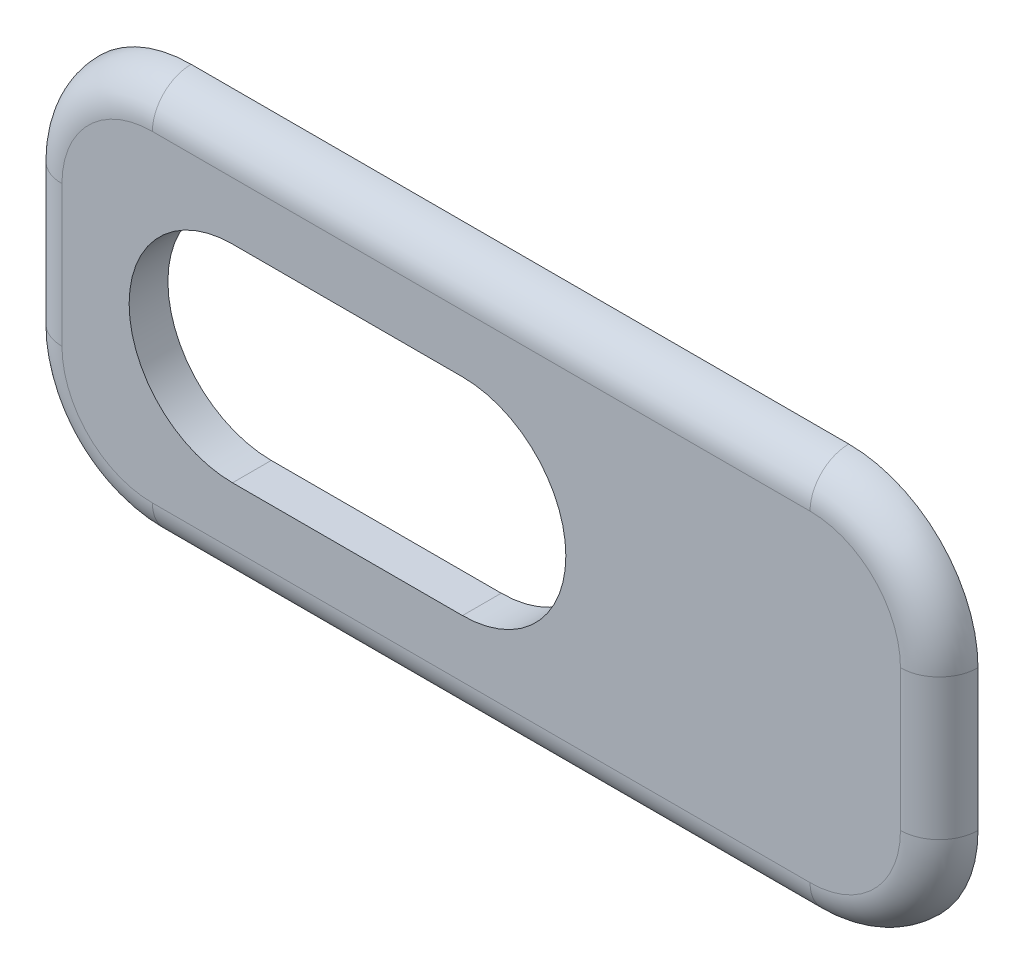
ISO-10303-21;
HEADER;
FILE_DESCRIPTION(('STEP AP214'),'2;1');
FILE_NAME('part.step','',(''),(''),'','','');
FILE_SCHEMA(('AUTOMOTIVE_DESIGN { 1 0 10303 214 1 1 1 1 }'));
ENDSEC;
DATA;
#1=APPLICATION_CONTEXT('core data for automotive mechanical design processes');
#2=APPLICATION_PROTOCOL_DEFINITION('international standard','automotive_design',2000,#1);
#3=PRODUCT_CONTEXT('',#1,'mechanical');
#4=PRODUCT('Part','Part','',(#3));
#5=PRODUCT_RELATED_PRODUCT_CATEGORY('part','',(#4));
#6=PRODUCT_DEFINITION_FORMATION('','',#4);
#7=PRODUCT_DEFINITION_CONTEXT('part definition',#1,'design');
#8=PRODUCT_DEFINITION('design','',#6,#7);
#9=PRODUCT_DEFINITION_SHAPE('','',#8);
#10=(LENGTH_UNIT() NAMED_UNIT(*) SI_UNIT(.MILLI.,.METRE.));
#11=(NAMED_UNIT(*) PLANE_ANGLE_UNIT() SI_UNIT($,.RADIAN.));
#12=(NAMED_UNIT(*) SI_UNIT($,.STERADIAN.) SOLID_ANGLE_UNIT());
#13=UNCERTAINTY_MEASURE_WITH_UNIT(LENGTH_MEASURE(1.E-05),#10,'distance_accuracy_value','');
#14=(GEOMETRIC_REPRESENTATION_CONTEXT(3) GLOBAL_UNCERTAINTY_ASSIGNED_CONTEXT((#13)) GLOBAL_UNIT_ASSIGNED_CONTEXT((#10,
#11,#12)) REPRESENTATION_CONTEXT('',''));
#15=CARTESIAN_POINT('',(0.,0.,0.));
#16=DIRECTION('',(0.,0.,1.));
#17=DIRECTION('',(1.,0.,0.));
#18=AXIS2_PLACEMENT_3D('',#15,#16,#17);
#19=CARTESIAN_POINT('',(-25.45,-5.45,1.5));
#20=DIRECTION('',(0.,0.,1.));
#21=DIRECTION('',(1.,0.,0.));
#22=AXIS2_PLACEMENT_3D('',#19,#20,#21);
#23=PLANE('',#22);
#24=CARTESIAN_POINT('',(-19.25,0.,1.5));
#25=DIRECTION('',(0.,0.,1.));
#26=DIRECTION('',(1.,0.,0.));
#27=AXIS2_PLACEMENT_3D('',#24,#25,#26);
#28=CIRCLE('',#27,8.);
#29=CARTESIAN_POINT('',(-19.25,8.,1.5));
#30=VERTEX_POINT('',#29);
#31=CARTESIAN_POINT('',(-19.25,-8.,1.5));
#32=VERTEX_POINT('',#31);
#33=EDGE_CURVE('E50',#30,#32,#28,.T.);
#34=ORIENTED_EDGE('',*,*,#33,.F.);
#35=DIRECTION('',(-1.,0.,0.));
#36=VECTOR('',#35,1.);
#37=CARTESIAN_POINT('',(-19.25,8.,1.5));
#38=LINE('',#37,#36);
#39=CARTESIAN_POINT('',(-1.45000000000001,8.,1.5));
#40=VERTEX_POINT('',#39);
#41=EDGE_CURVE('E142',#40,#30,#38,.T.);
#42=ORIENTED_EDGE('',*,*,#41,.F.);
#43=CARTESIAN_POINT('',(-1.45000000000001,0.,1.5));
#44=DIRECTION('',(0.,0.,1.));
#45=DIRECTION('',(1.,0.,0.));
#46=AXIS2_PLACEMENT_3D('',#43,#44,#45);
#47=CIRCLE('',#46,8.);
#48=CARTESIAN_POINT('',(-1.45000000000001,-8.,1.5));
#49=VERTEX_POINT('',#48);
#50=EDGE_CURVE('E145',#49,#40,#47,.T.);
#51=ORIENTED_EDGE('',*,*,#50,.F.);
#52=DIRECTION('',(1.,0.,0.));
#53=VECTOR('',#52,1.);
#54=CARTESIAN_POINT('',(-19.25,-8.,1.5));
#55=LINE('',#54,#53);
#56=EDGE_CURVE('E151',#32,#49,#55,.T.);
#57=ORIENTED_EDGE('',*,*,#56,.F.);
#58=EDGE_LOOP('',(#34,#42,#51,#57));
#59=FACE_BOUND('',#58,.T.);
#60=DIRECTION('',(0.,1.,0.));
#61=VECTOR('',#60,1.);
#62=CARTESIAN_POINT('',(32.45,5.44999999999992,1.5));
#63=LINE('',#62,#61);
#64=CARTESIAN_POINT('',(32.45,-5.44999999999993,1.5));
#65=VERTEX_POINT('',#64);
#66=CARTESIAN_POINT('',(32.45,5.44999999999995,1.5));
#67=VERTEX_POINT('',#66);
#68=EDGE_CURVE('E42',#65,#67,#63,.T.);
#69=ORIENTED_EDGE('',*,*,#68,.T.);
#70=CARTESIAN_POINT('',(25.45,5.44999999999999,1.5));
#71=DIRECTION('',(0.,0.,1.));
#72=DIRECTION('',(1.,0.,0.));
#73=AXIS2_PLACEMENT_3D('',#70,#71,#72);
#74=CIRCLE('',#73,7.);
#75=CARTESIAN_POINT('',(25.45,12.45,1.5));
#76=VERTEX_POINT('',#75);
#77=EDGE_CURVE('E11',#67,#76,#74,.T.);
#78=ORIENTED_EDGE('',*,*,#77,.T.);
#79=DIRECTION('',(-1.,0.,0.));
#80=VECTOR('',#79,1.);
#81=CARTESIAN_POINT('',(-25.4499999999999,12.45,1.5));
#82=LINE('',#81,#80);
#83=CARTESIAN_POINT('',(-25.45,12.45,1.5));
#84=VERTEX_POINT('',#83);
#85=EDGE_CURVE('E185',#76,#84,#82,.T.);
#86=ORIENTED_EDGE('',*,*,#85,.T.);
#87=CARTESIAN_POINT('',(-25.45,5.45,1.5));
#88=DIRECTION('',(0.,0.,1.));
#89=DIRECTION('',(1.,0.,0.));
#90=AXIS2_PLACEMENT_3D('',#87,#88,#89);
#91=CIRCLE('',#90,7.);
#92=CARTESIAN_POINT('',(-32.45,5.44999999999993,1.5));
#93=VERTEX_POINT('',#92);
#94=EDGE_CURVE('E187',#84,#93,#91,.T.);
#95=ORIENTED_EDGE('',*,*,#94,.T.);
#96=DIRECTION('',(0.,-1.,0.));
#97=VECTOR('',#96,1.);
#98=CARTESIAN_POINT('',(-32.45,-5.44999999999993,1.5));
#99=LINE('',#98,#97);
#100=CARTESIAN_POINT('',(-32.45,-5.44999999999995,1.5));
#101=VERTEX_POINT('',#100);
#102=EDGE_CURVE('E189',#93,#101,#99,.T.);
#103=ORIENTED_EDGE('',*,*,#102,.T.);
#104=CARTESIAN_POINT('',(-25.45,-5.45,1.5));
#105=DIRECTION('',(0.,0.,1.));
#106=DIRECTION('',(1.,0.,0.));
#107=AXIS2_PLACEMENT_3D('',#104,#105,#106);
#108=CIRCLE('',#107,7.);
#109=CARTESIAN_POINT('',(-25.4499999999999,-12.45,1.5));
#110=VERTEX_POINT('',#109);
#111=EDGE_CURVE('E191',#101,#110,#108,.T.);
#112=ORIENTED_EDGE('',*,*,#111,.T.);
#113=DIRECTION('',(1.,0.,0.));
#114=VECTOR('',#113,1.);
#115=CARTESIAN_POINT('',(25.4499999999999,-12.45,1.5));
#116=LINE('',#115,#114);
#117=CARTESIAN_POINT('',(25.45,-12.45,1.5));
#118=VERTEX_POINT('',#117);
#119=EDGE_CURVE('E193',#110,#118,#116,.T.);
#120=ORIENTED_EDGE('',*,*,#119,.T.);
#121=CARTESIAN_POINT('',(25.45,-5.45,1.5));
#122=DIRECTION('',(0.,0.,1.));
#123=DIRECTION('',(1.,0.,0.));
#124=AXIS2_PLACEMENT_3D('',#121,#122,#123);
#125=CIRCLE('',#124,7.);
#126=EDGE_CURVE('E195',#118,#65,#125,.T.);
#127=ORIENTED_EDGE('',*,*,#126,.T.);
#128=EDGE_LOOP('',(#69,#78,#86,#95,#103,#112,#120,#127));
#129=FACE_BOUND('',#128,.T.);
#130=ADVANCED_FACE('F33',(#59,#129),#23,.T.);
#131=CARTESIAN_POINT('',(-25.45,-5.45,-1.5));
#132=DIRECTION('',(0.,0.,1.));
#133=DIRECTION('',(1.,0.,0.));
#134=AXIS2_PLACEMENT_3D('',#131,#132,#133);
#135=PLANE('',#134);
#136=DIRECTION('',(-1.,0.,0.));
#137=VECTOR('',#136,1.);
#138=CARTESIAN_POINT('',(-19.25,8.,-1.5));
#139=LINE('',#138,#137);
#140=CARTESIAN_POINT('',(-1.45000000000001,8.,-1.5));
#141=VERTEX_POINT('',#140);
#142=CARTESIAN_POINT('',(-19.25,8.,-1.5));
#143=VERTEX_POINT('',#142);
#144=EDGE_CURVE('E132',#141,#143,#139,.T.);
#145=ORIENTED_EDGE('',*,*,#144,.T.);
#146=CARTESIAN_POINT('',(-19.25,0.,-1.5));
#147=DIRECTION('',(0.,0.,1.));
#148=DIRECTION('',(1.,0.,0.));
#149=AXIS2_PLACEMENT_3D('',#146,#147,#148);
#150=CIRCLE('',#149,8.);
#151=CARTESIAN_POINT('',(-19.25,-8.,-1.5));
#152=VERTEX_POINT('',#151);
#153=EDGE_CURVE('E126',#143,#152,#150,.T.);
#154=ORIENTED_EDGE('',*,*,#153,.T.);
#155=DIRECTION('',(1.,0.,0.));
#156=VECTOR('',#155,1.);
#157=CARTESIAN_POINT('',(-19.25,-8.,-1.5));
#158=LINE('',#157,#156);
#159=CARTESIAN_POINT('',(-1.45000000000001,-8.,-1.5));
#160=VERTEX_POINT('',#159);
#161=EDGE_CURVE('E135',#152,#160,#158,.T.);
#162=ORIENTED_EDGE('',*,*,#161,.T.);
#163=CARTESIAN_POINT('',(-1.45000000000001,0.,-1.5));
#164=DIRECTION('',(0.,0.,1.));
#165=DIRECTION('',(1.,0.,0.));
#166=AXIS2_PLACEMENT_3D('',#163,#164,#165);
#167=CIRCLE('',#166,8.);
#168=EDGE_CURVE('E58',#160,#141,#167,.T.);
#169=ORIENTED_EDGE('',*,*,#168,.T.);
#170=EDGE_LOOP('',(#145,#154,#162,#169));
#171=FACE_BOUND('',#170,.T.);
#172=CARTESIAN_POINT('',(-25.45,-5.45,-1.5));
#173=DIRECTION('',(0.,0.,1.));
#174=DIRECTION('',(1.,0.,0.));
#175=AXIS2_PLACEMENT_3D('',#172,#173,#174);
#176=CIRCLE('',#175,10.);
#177=CARTESIAN_POINT('',(-35.45,-5.44999999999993,-1.5));
#178=VERTEX_POINT('',#177);
#179=CARTESIAN_POINT('',(-25.4499999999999,-15.45,-1.5));
#180=VERTEX_POINT('',#179);
#181=EDGE_CURVE('E161',#178,#180,#176,.T.);
#182=ORIENTED_EDGE('',*,*,#181,.F.);
#183=DIRECTION('',(0.,-1.,0.));
#184=VECTOR('',#183,1.);
#185=CARTESIAN_POINT('',(-35.45,5.44999999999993,-1.5));
#186=LINE('',#185,#184);
#187=CARTESIAN_POINT('',(-35.45,5.44999999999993,-1.5));
#188=VERTEX_POINT('',#187);
#189=EDGE_CURVE('E182',#188,#178,#186,.T.);
#190=ORIENTED_EDGE('',*,*,#189,.F.);
#191=CARTESIAN_POINT('',(-25.45,5.45,-1.5));
#192=DIRECTION('',(0.,0.,1.));
#193=DIRECTION('',(1.,0.,0.));
#194=AXIS2_PLACEMENT_3D('',#191,#192,#193);
#195=CIRCLE('',#194,10.);
#196=CARTESIAN_POINT('',(-25.4499999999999,15.45,-1.5));
#197=VERTEX_POINT('',#196);
#198=EDGE_CURVE('E179',#197,#188,#195,.T.);
#199=ORIENTED_EDGE('',*,*,#198,.F.);
#200=DIRECTION('',(-1.,0.,0.));
#201=VECTOR('',#200,1.);
#202=CARTESIAN_POINT('',(-25.4499999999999,15.45,-1.5));
#203=LINE('',#202,#201);
#204=CARTESIAN_POINT('',(25.4499999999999,15.45,-1.5));
#205=VERTEX_POINT('',#204);
#206=EDGE_CURVE('E176',#205,#197,#203,.T.);
#207=ORIENTED_EDGE('',*,*,#206,.F.);
#208=CARTESIAN_POINT('',(25.45,5.44999999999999,-1.5));
#209=DIRECTION('',(0.,0.,1.));
#210=DIRECTION('',(1.,0.,0.));
#211=AXIS2_PLACEMENT_3D('',#208,#209,#210);
#212=CIRCLE('',#211,10.);
#213=CARTESIAN_POINT('',(35.45,5.44999999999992,-1.5));
#214=VERTEX_POINT('',#213);
#215=EDGE_CURVE('E173',#214,#205,#212,.T.);
#216=ORIENTED_EDGE('',*,*,#215,.F.);
#217=DIRECTION('',(0.,1.,0.));
#218=VECTOR('',#217,1.);
#219=CARTESIAN_POINT('',(35.45,5.44999999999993,-1.5));
#220=LINE('',#219,#218);
#221=CARTESIAN_POINT('',(35.45,-5.44999999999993,-1.5));
#222=VERTEX_POINT('',#221);
#223=EDGE_CURVE('E170',#222,#214,#220,.T.);
#224=ORIENTED_EDGE('',*,*,#223,.F.);
#225=CARTESIAN_POINT('',(25.45,-5.45,-1.5));
#226=DIRECTION('',(0.,0.,1.));
#227=DIRECTION('',(1.,0.,0.));
#228=AXIS2_PLACEMENT_3D('',#225,#226,#227);
#229=CIRCLE('',#228,10.);
#230=CARTESIAN_POINT('',(25.4499999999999,-15.45,-1.5));
#231=VERTEX_POINT('',#230);
#232=EDGE_CURVE('E167',#231,#222,#229,.T.);
#233=ORIENTED_EDGE('',*,*,#232,.F.);
#234=DIRECTION('',(1.,0.,0.));
#235=VECTOR('',#234,1.);
#236=CARTESIAN_POINT('',(-25.4499999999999,-15.45,-1.5));
#237=LINE('',#236,#235);
#238=EDGE_CURVE('E164',#180,#231,#237,.T.);
#239=ORIENTED_EDGE('',*,*,#238,.F.);
#240=EDGE_LOOP('',(#182,#190,#199,#207,#216,#224,#233,#239));
#241=FACE_BOUND('',#240,.T.);
#242=ADVANCED_FACE('F139',(#171,#241),#135,.F.);
#243=CARTESIAN_POINT('',(-25.45,-5.45,-1.5));
#244=DIRECTION('',(0.,0.,1.));
#245=DIRECTION('',(1.,0.,0.));
#246=AXIS2_PLACEMENT_3D('',#243,#244,#245);
#247=TOROIDAL_SURFACE('',#246,7.,3.);
#248=CARTESIAN_POINT('',(-32.45,-5.44999999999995,-1.5));
#249=DIRECTION('',(0.,1.,0.));
#250=DIRECTION('',(-1.,0.,0.));
#251=AXIS2_PLACEMENT_3D('',#248,#249,#250);
#252=CIRCLE('',#251,3.);
#253=EDGE_CURVE('E212',#178,#101,#252,.T.);
#254=ORIENTED_EDGE('',*,*,#253,.F.);
#255=ORIENTED_EDGE('',*,*,#181,.T.);
#256=CARTESIAN_POINT('',(-25.4499999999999,-12.45,-1.5));
#257=DIRECTION('',(1.,0.,0.));
#258=DIRECTION('',(0.,0.,-1.));
#259=AXIS2_PLACEMENT_3D('',#256,#257,#258);
#260=CIRCLE('',#259,3.);
#261=EDGE_CURVE('E37',#110,#180,#260,.T.);
#262=ORIENTED_EDGE('',*,*,#261,.F.);
#263=ORIENTED_EDGE('',*,*,#111,.F.);
#264=EDGE_LOOP('',(#254,#255,#262,#263));
#265=FACE_BOUND('',#264,.T.);
#266=ADVANCED_FACE('F35',(#265),#247,.T.);
#267=CARTESIAN_POINT('',(-25.45,-12.45,-1.5));
#268=DIRECTION('',(-1.,0.,0.));
#269=DIRECTION('',(0.,0.,1.));
#270=AXIS2_PLACEMENT_3D('',#267,#268,#269);
#271=CYLINDRICAL_SURFACE('',#270,3.);
#272=ORIENTED_EDGE('',*,*,#261,.T.);
#273=ORIENTED_EDGE('',*,*,#238,.T.);
#274=CARTESIAN_POINT('',(25.45,-12.45,-1.5));
#275=DIRECTION('',(1.,0.,0.));
#276=DIRECTION('',(0.,1.,0.));
#277=AXIS2_PLACEMENT_3D('',#274,#275,#276);
#278=CIRCLE('',#277,3.);
#279=EDGE_CURVE('E210',#118,#231,#278,.T.);
#280=ORIENTED_EDGE('',*,*,#279,.F.);
#281=ORIENTED_EDGE('',*,*,#119,.F.);
#282=EDGE_LOOP('',(#272,#273,#280,#281));
#283=FACE_BOUND('',#282,.T.);
#284=ADVANCED_FACE('F221',(#283),#271,.T.);
#285=CARTESIAN_POINT('',(-32.45,-5.45,-1.5));
#286=DIRECTION('',(0.,1.,0.));
#287=DIRECTION('',(0.,0.,1.));
#288=AXIS2_PLACEMENT_3D('',#285,#286,#287);
#289=CYLINDRICAL_SURFACE('',#288,3.);
#290=ORIENTED_EDGE('',*,*,#253,.T.);
#291=ORIENTED_EDGE('',*,*,#102,.F.);
#292=CARTESIAN_POINT('',(-32.45,5.44999999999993,-1.5));
#293=DIRECTION('',(0.,1.,0.));
#294=DIRECTION('',(0.,0.,1.));
#295=AXIS2_PLACEMENT_3D('',#292,#293,#294);
#296=CIRCLE('',#295,3.);
#297=EDGE_CURVE('E207',#188,#93,#296,.T.);
#298=ORIENTED_EDGE('',*,*,#297,.F.);
#299=ORIENTED_EDGE('',*,*,#189,.T.);
#300=EDGE_LOOP('',(#290,#291,#298,#299));
#301=FACE_BOUND('',#300,.T.);
#302=ADVANCED_FACE('F238',(#301),#289,.T.);
#303=CARTESIAN_POINT('',(25.45,-5.45,-1.5));
#304=DIRECTION('',(0.,0.,1.));
#305=DIRECTION('',(1.,0.,0.));
#306=AXIS2_PLACEMENT_3D('',#303,#304,#305);
#307=TOROIDAL_SURFACE('',#306,7.,3.);
#308=ORIENTED_EDGE('',*,*,#279,.T.);
#309=ORIENTED_EDGE('',*,*,#232,.T.);
#310=CARTESIAN_POINT('',(32.45,-5.44999999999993,-1.5));
#311=DIRECTION('',(0.,1.,0.));
#312=DIRECTION('',(-1.,0.,0.));
#313=AXIS2_PLACEMENT_3D('',#310,#311,#312);
#314=CIRCLE('',#313,3.);
#315=EDGE_CURVE('E204',#65,#222,#314,.T.);
#316=ORIENTED_EDGE('',*,*,#315,.F.);
#317=ORIENTED_EDGE('',*,*,#126,.F.);
#318=EDGE_LOOP('',(#308,#309,#316,#317));
#319=FACE_BOUND('',#318,.T.);
#320=ADVANCED_FACE('F229',(#319),#307,.T.);
#321=CARTESIAN_POINT('',(-25.45,5.45,-1.5));
#322=DIRECTION('',(0.,0.,1.));
#323=DIRECTION('',(1.,0.,0.));
#324=AXIS2_PLACEMENT_3D('',#321,#322,#323);
#325=TOROIDAL_SURFACE('',#324,7.,3.);
#326=ORIENTED_EDGE('',*,*,#297,.T.);
#327=ORIENTED_EDGE('',*,*,#94,.F.);
#328=CARTESIAN_POINT('',(-25.45,12.45,-1.5));
#329=DIRECTION('',(1.,0.,0.));
#330=DIRECTION('',(0.,1.,0.));
#331=AXIS2_PLACEMENT_3D('',#328,#329,#330);
#332=CIRCLE('',#331,3.);
#333=EDGE_CURVE('E201',#197,#84,#332,.T.);
#334=ORIENTED_EDGE('',*,*,#333,.F.);
#335=ORIENTED_EDGE('',*,*,#198,.T.);
#336=EDGE_LOOP('',(#326,#327,#334,#335));
#337=FACE_BOUND('',#336,.T.);
#338=ADVANCED_FACE('F240',(#337),#325,.T.);
#339=CARTESIAN_POINT('',(32.45,-5.44999999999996,-1.5));
#340=DIRECTION('',(0.,-1.,0.));
#341=DIRECTION('',(1.,0.,0.));
#342=AXIS2_PLACEMENT_3D('',#339,#340,#341);
#343=CYLINDRICAL_SURFACE('',#342,3.);
#344=ORIENTED_EDGE('',*,*,#315,.T.);
#345=ORIENTED_EDGE('',*,*,#223,.T.);
#346=CARTESIAN_POINT('',(32.45,5.44999999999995,-1.5));
#347=DIRECTION('',(0.,1.,0.));
#348=DIRECTION('',(-1.,0.,0.));
#349=AXIS2_PLACEMENT_3D('',#346,#347,#348);
#350=CIRCLE('',#349,3.);
#351=EDGE_CURVE('E199',#67,#214,#350,.T.);
#352=ORIENTED_EDGE('',*,*,#351,.F.);
#353=ORIENTED_EDGE('',*,*,#68,.F.);
#354=EDGE_LOOP('',(#344,#345,#352,#353));
#355=FACE_BOUND('',#354,.T.);
#356=ADVANCED_FACE('F233',(#355),#343,.T.);
#357=CARTESIAN_POINT('',(-25.45,12.45,-1.5));
#358=DIRECTION('',(1.,0.,0.));
#359=DIRECTION('',(0.,0.,-1.));
#360=AXIS2_PLACEMENT_3D('',#357,#358,#359);
#361=CYLINDRICAL_SURFACE('',#360,3.);
#362=ORIENTED_EDGE('',*,*,#333,.T.);
#363=ORIENTED_EDGE('',*,*,#85,.F.);
#364=CARTESIAN_POINT('',(25.4499999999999,12.45,-1.5));
#365=DIRECTION('',(1.,0.,0.));
#366=DIRECTION('',(0.,0.,-1.));
#367=AXIS2_PLACEMENT_3D('',#364,#365,#366);
#368=CIRCLE('',#367,3.);
#369=EDGE_CURVE('E157',#205,#76,#368,.T.);
#370=ORIENTED_EDGE('',*,*,#369,.F.);
#371=ORIENTED_EDGE('',*,*,#206,.T.);
#372=EDGE_LOOP('',(#362,#363,#370,#371));
#373=FACE_BOUND('',#372,.T.);
#374=ADVANCED_FACE('F247',(#373),#361,.T.);
#375=CARTESIAN_POINT('',(25.45,5.44999999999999,-1.5));
#376=DIRECTION('',(0.,0.,1.));
#377=DIRECTION('',(1.,0.,0.));
#378=AXIS2_PLACEMENT_3D('',#375,#376,#377);
#379=TOROIDAL_SURFACE('',#378,7.,3.);
#380=ORIENTED_EDGE('',*,*,#351,.T.);
#381=ORIENTED_EDGE('',*,*,#215,.T.);
#382=ORIENTED_EDGE('',*,*,#369,.T.);
#383=ORIENTED_EDGE('',*,*,#77,.F.);
#384=EDGE_LOOP('',(#380,#381,#382,#383));
#385=FACE_BOUND('',#384,.T.);
#386=ADVANCED_FACE('F245',(#385),#379,.T.);
#387=CARTESIAN_POINT('',(-19.25,0.,-1.5));
#388=DIRECTION('',(0.,0.,1.));
#389=DIRECTION('',(1.,0.,0.));
#390=AXIS2_PLACEMENT_3D('',#387,#388,#389);
#391=CYLINDRICAL_SURFACE('',#390,8.);
#392=ORIENTED_EDGE('',*,*,#33,.T.);
#393=DIRECTION('',(0.,0.,1.));
#394=VECTOR('',#393,1.);
#395=CARTESIAN_POINT('',(-19.25,-8.,-1.5));
#396=LINE('',#395,#394);
#397=EDGE_CURVE('E122',#152,#32,#396,.T.);
#398=ORIENTED_EDGE('',*,*,#397,.F.);
#399=ORIENTED_EDGE('',*,*,#153,.F.);
#400=DIRECTION('',(0.,0.,1.));
#401=VECTOR('',#400,1.);
#402=CARTESIAN_POINT('',(-19.25,8.,-1.5));
#403=LINE('',#402,#401);
#404=EDGE_CURVE('E155',#143,#30,#403,.T.);
#405=ORIENTED_EDGE('',*,*,#404,.T.);
#406=EDGE_LOOP('',(#392,#398,#399,#405));
#407=FACE_BOUND('',#406,.T.);
#408=ADVANCED_FACE('F124',(#407),#391,.F.);
#409=CARTESIAN_POINT('',(-19.25,8.,-1.5));
#410=DIRECTION('',(0.,1.,0.));
#411=DIRECTION('',(0.,0.,1.));
#412=AXIS2_PLACEMENT_3D('',#409,#410,#411);
#413=PLANE('',#412);
#414=ORIENTED_EDGE('',*,*,#41,.T.);
#415=ORIENTED_EDGE('',*,*,#404,.F.);
#416=ORIENTED_EDGE('',*,*,#144,.F.);
#417=DIRECTION('',(0.,0.,1.));
#418=VECTOR('',#417,1.);
#419=CARTESIAN_POINT('',(-1.45000000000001,8.,-1.5));
#420=LINE('',#419,#418);
#421=EDGE_CURVE('E158',#141,#40,#420,.T.);
#422=ORIENTED_EDGE('',*,*,#421,.T.);
#423=EDGE_LOOP('',(#414,#415,#416,#422));
#424=FACE_BOUND('',#423,.T.);
#425=ADVANCED_FACE('F266',(#424),#413,.F.);
#426=CARTESIAN_POINT('',(-1.45000000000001,0.,-1.5));
#427=DIRECTION('',(0.,0.,1.));
#428=DIRECTION('',(1.,0.,0.));
#429=AXIS2_PLACEMENT_3D('',#426,#427,#428);
#430=CYLINDRICAL_SURFACE('',#429,8.);
#431=ORIENTED_EDGE('',*,*,#50,.T.);
#432=ORIENTED_EDGE('',*,*,#421,.F.);
#433=ORIENTED_EDGE('',*,*,#168,.F.);
#434=DIRECTION('',(0.,0.,1.));
#435=VECTOR('',#434,1.);
#436=CARTESIAN_POINT('',(-1.45000000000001,-8.,-1.5));
#437=LINE('',#436,#435);
#438=EDGE_CURVE('E131',#160,#49,#437,.T.);
#439=ORIENTED_EDGE('',*,*,#438,.T.);
#440=EDGE_LOOP('',(#431,#432,#433,#439));
#441=FACE_BOUND('',#440,.T.);
#442=ADVANCED_FACE('F269',(#441),#430,.F.);
#443=CARTESIAN_POINT('',(-19.25,-8.,-1.5));
#444=DIRECTION('',(0.,-1.,0.));
#445=DIRECTION('',(0.,0.,-1.));
#446=AXIS2_PLACEMENT_3D('',#443,#444,#445);
#447=PLANE('',#446);
#448=ORIENTED_EDGE('',*,*,#56,.T.);
#449=ORIENTED_EDGE('',*,*,#438,.F.);
#450=ORIENTED_EDGE('',*,*,#161,.F.);
#451=ORIENTED_EDGE('',*,*,#397,.T.);
#452=EDGE_LOOP('',(#448,#449,#450,#451));
#453=FACE_BOUND('',#452,.T.);
#454=ADVANCED_FACE('F136',(#453),#447,.F.);
#455=CLOSED_SHELL('',(#130,#242,#266,#284,#302,#320,#338,#356,#374,#386,#408,#425,#442,#454));
#456=MANIFOLD_SOLID_BREP('B2',#455);
#457=ADVANCED_BREP_SHAPE_REPRESENTATION('',(#18,#456),#14);
#458=SHAPE_DEFINITION_REPRESENTATION(#9,#457);
ENDSEC;
END-ISO-10303-21;
